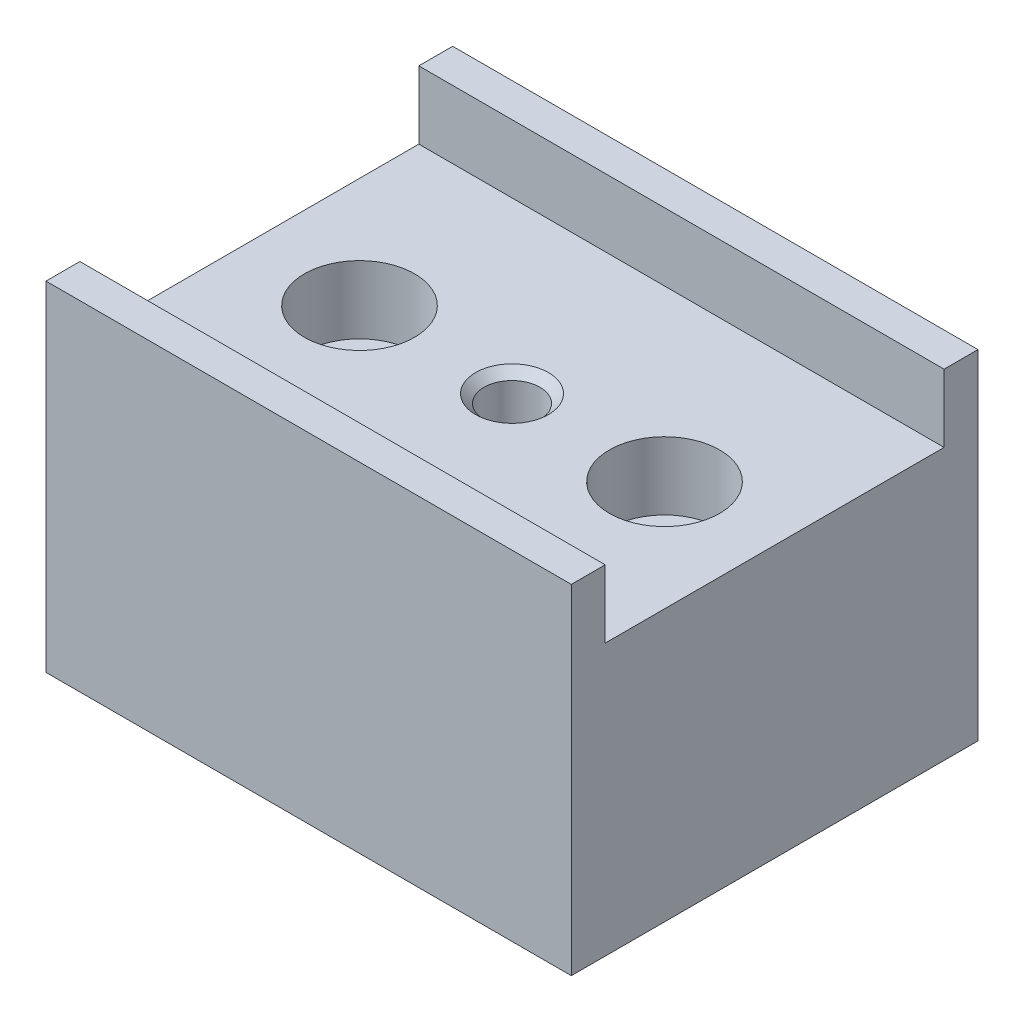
from build123d import *

# Parameters (mm, degrees)
EXTRUDE_1_DEPTH     = 31
HOLE_WIZARD_M41_D   = 3.3
CHAMFER_1_SIZE      = 0.5
SKETCH_4_R          = 1.7
CUT_EXTRUDE_1_DEPTH = 37.891733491
SKETCH_5_R          = 3.25
CUT_EXTRUDE_2_DEPTH = 4


with BuildPart() as part:
    # Sketch 1 → Extrude 1 (new body)
    with BuildSketch(Plane(origin=(0, 0, 0), x_dir=(0, 0, -1), z_dir=(1, 0, 0))):
        Polygon((12, 0), (-12, 0), (-12, 20), (-10, 20), (-10, 16), (10, 16), (10, 20), (12, 20), align=None)
    extrude(amount=-EXTRUDE_1_DEPTH)

    # Hole Wizard M41 (through all)
    with Locations(Plane(origin=(0, 16, 0), x_dir=(1, 0, 0), z_dir=(0, 1, 0))):
        with Locations((-15.5, 0)):
            Hole(HOLE_WIZARD_M41_D / 2)

    # Chamfer 1
    chamfer_1_edges = [part.edges().sort_by_distance(p)[0] for p in [
        (-13.85, 16, 0),
    ]]
    chamfer(chamfer_1_edges, length=CHAMFER_1_SIZE)

    # Sketch 4 → Cut-Extrude 1 (cut, through all)
    with BuildSketch(Plane(origin=(0, 16, 0), x_dir=(1, 0, 0), z_dir=(0, 1, 0))):
        with Locations(Location((-24.5, 0, 0), (0, 0, 270))):
            Circle(SKETCH_4_R)
        with Locations(Location((-6.5, 0, 0), (0, 0, 270))):
            Circle(SKETCH_4_R)
    extrude(amount=-CUT_EXTRUDE_1_DEPTH, mode=Mode.SUBTRACT)

    # Sketch 5 → Cut-Extrude 2 (cut)
    with BuildSketch(Plane(origin=(0, 16, 0), x_dir=(1, 0, 0), z_dir=(0, 1, 0))):
        with Locations(Location((-24.5, 0, 0), (0, 0, 270))):
            Circle(SKETCH_5_R)
        with Locations(Location((-6.5, 0, 0), (0, 0, 270))):
            Circle(SKETCH_5_R)
    extrude(amount=-CUT_EXTRUDE_2_DEPTH, mode=Mode.SUBTRACT)


solid = part.part
